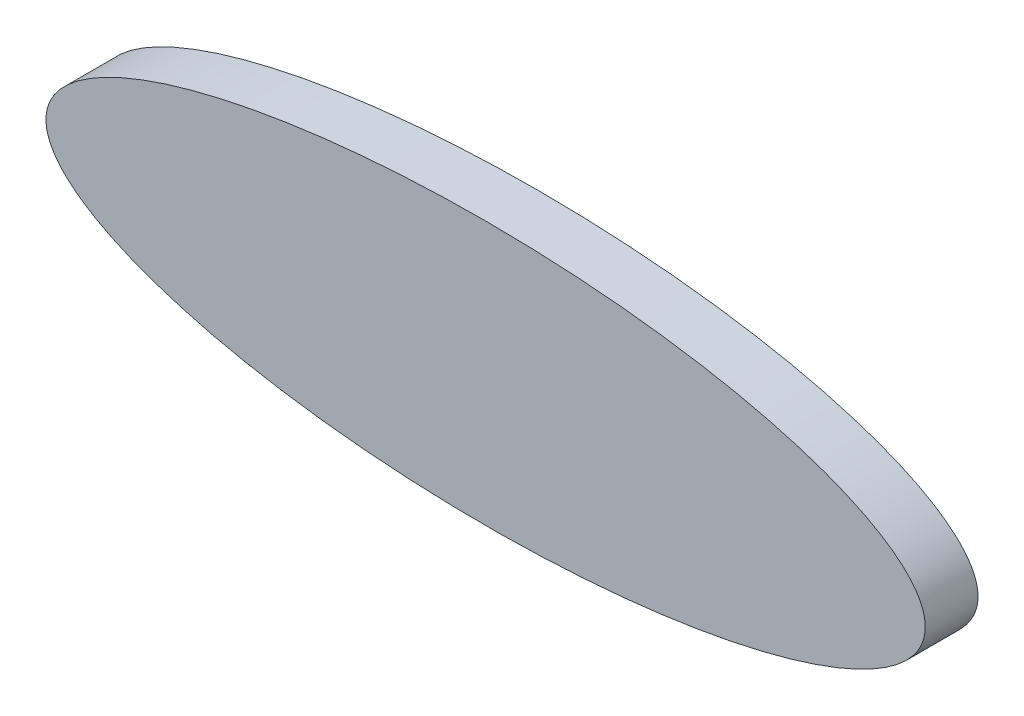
ISO-10303-21;
HEADER;
FILE_DESCRIPTION(('STEP AP214'),'2;1');
FILE_NAME('part.step','',(''),(''),'','','');
FILE_SCHEMA(('AUTOMOTIVE_DESIGN { 1 0 10303 214 1 1 1 1 }'));
ENDSEC;
DATA;
#1=APPLICATION_CONTEXT('core data for automotive mechanical design processes');
#2=APPLICATION_PROTOCOL_DEFINITION('international standard','automotive_design',2000,#1);
#3=PRODUCT_CONTEXT('',#1,'mechanical');
#4=PRODUCT('Part','Part','',(#3));
#5=PRODUCT_RELATED_PRODUCT_CATEGORY('part','',(#4));
#6=PRODUCT_DEFINITION_FORMATION('','',#4);
#7=PRODUCT_DEFINITION_CONTEXT('part definition',#1,'design');
#8=PRODUCT_DEFINITION('design','',#6,#7);
#9=PRODUCT_DEFINITION_SHAPE('','',#8);
#10=(LENGTH_UNIT() NAMED_UNIT(*) SI_UNIT(.MILLI.,.METRE.));
#11=(NAMED_UNIT(*) PLANE_ANGLE_UNIT() SI_UNIT($,.RADIAN.));
#12=(NAMED_UNIT(*) SI_UNIT($,.STERADIAN.) SOLID_ANGLE_UNIT());
#13=UNCERTAINTY_MEASURE_WITH_UNIT(LENGTH_MEASURE(1.E-05),#10,'distance_accuracy_value','');
#14=(GEOMETRIC_REPRESENTATION_CONTEXT(3) GLOBAL_UNCERTAINTY_ASSIGNED_CONTEXT((#13)) GLOBAL_UNIT_ASSIGNED_CONTEXT((#10,
#11,#12)) REPRESENTATION_CONTEXT('',''));
#15=CARTESIAN_POINT('',(0.,0.,0.));
#16=DIRECTION('',(0.,0.,1.));
#17=DIRECTION('',(1.,0.,0.));
#18=AXIS2_PLACEMENT_3D('',#15,#16,#17);
#19=CARTESIAN_POINT('',(0.,0.,3.));
#20=DIRECTION('',(0.,0.,1.));
#21=DIRECTION('',(1.,0.,0.));
#22=AXIS2_PLACEMENT_3D('',#19,#20,#21);
#23=ELLIPSE('',#22,25.,7.5);
#24=DIRECTION('',(0.,0.,-1.));
#25=VECTOR('',#24,1.);
#26=SURFACE_OF_LINEAR_EXTRUSION('',#23,#25);
#27=CARTESIAN_POINT('',(25.,0.,3.));
#28=VERTEX_POINT('',#27);
#29=EDGE_CURVE('E10',#28,#28,#23,.T.);
#30=ORIENTED_EDGE('',*,*,#29,.F.);
#31=EDGE_LOOP('',(#30));
#32=FACE_BOUND('',#31,.T.);
#33=CARTESIAN_POINT('',(0.,0.,0.));
#34=DIRECTION('',(0.,0.,1.));
#35=DIRECTION('',(1.,0.,0.));
#36=AXIS2_PLACEMENT_3D('',#33,#34,#35);
#37=ELLIPSE('',#36,25.,7.5);
#38=CARTESIAN_POINT('',(25.,0.,0.));
#39=VERTEX_POINT('',#38);
#40=EDGE_CURVE('E34',#39,#39,#37,.T.);
#41=ORIENTED_EDGE('',*,*,#40,.T.);
#42=EDGE_LOOP('',(#41));
#43=FACE_BOUND('',#42,.T.);
#44=ADVANCED_FACE('F27',(#32,#43),#26,.F.);
#45=CARTESIAN_POINT('',(0.,0.,3.));
#46=DIRECTION('',(0.,0.,1.));
#47=DIRECTION('',(1.,0.,0.));
#48=AXIS2_PLACEMENT_3D('',#45,#46,#47);
#49=PLANE('',#48);
#50=ORIENTED_EDGE('',*,*,#29,.T.);
#51=EDGE_LOOP('',(#50));
#52=FACE_BOUND('',#51,.T.);
#53=ADVANCED_FACE('F43',(#52),#49,.T.);
#54=CARTESIAN_POINT('',(0.,0.,0.));
#55=DIRECTION('',(0.,0.,1.));
#56=DIRECTION('',(1.,0.,0.));
#57=AXIS2_PLACEMENT_3D('',#54,#55,#56);
#58=PLANE('',#57);
#59=ORIENTED_EDGE('',*,*,#40,.F.);
#60=EDGE_LOOP('',(#59));
#61=FACE_BOUND('',#60,.T.);
#62=ADVANCED_FACE('F41',(#61),#58,.F.);
#63=CLOSED_SHELL('',(#44,#53,#62));
#64=MANIFOLD_SOLID_BREP('B2',#63);
#65=ADVANCED_BREP_SHAPE_REPRESENTATION('',(#18,#64),#14);
#66=SHAPE_DEFINITION_REPRESENTATION(#9,#65);
ENDSEC;
END-ISO-10303-21;
